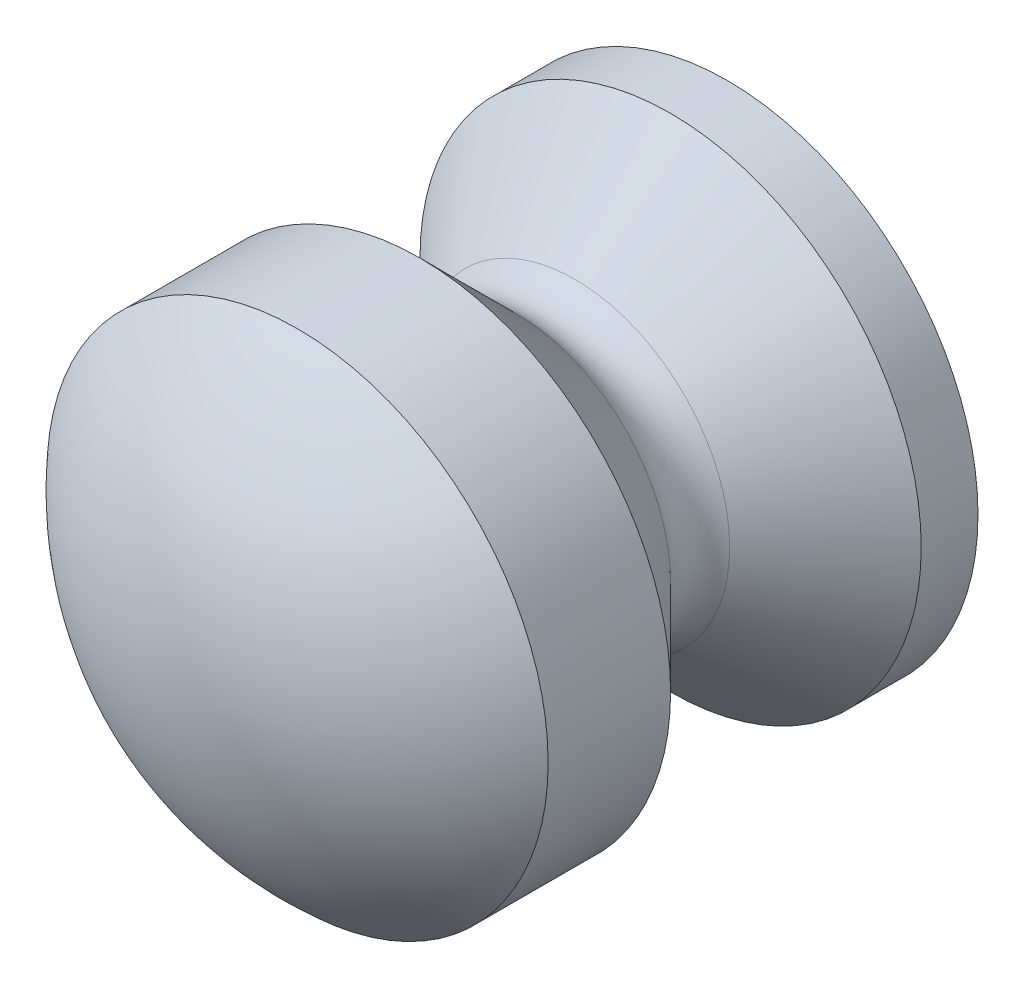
ISO-10303-21;
HEADER;
FILE_DESCRIPTION(('STEP AP214'),'2;1');
FILE_NAME('part.step','',(''),(''),'','','');
FILE_SCHEMA(('AUTOMOTIVE_DESIGN { 1 0 10303 214 1 1 1 1 }'));
ENDSEC;
DATA;
#1=APPLICATION_CONTEXT('core data for automotive mechanical design processes');
#2=APPLICATION_PROTOCOL_DEFINITION('international standard','automotive_design',2000,#1);
#3=PRODUCT_CONTEXT('',#1,'mechanical');
#4=PRODUCT('Part','Part','',(#3));
#5=PRODUCT_RELATED_PRODUCT_CATEGORY('part','',(#4));
#6=PRODUCT_DEFINITION_FORMATION('','',#4);
#7=PRODUCT_DEFINITION_CONTEXT('part definition',#1,'design');
#8=PRODUCT_DEFINITION('design','',#6,#7);
#9=PRODUCT_DEFINITION_SHAPE('','',#8);
#10=(LENGTH_UNIT() NAMED_UNIT(*) SI_UNIT(.MILLI.,.METRE.));
#11=(NAMED_UNIT(*) PLANE_ANGLE_UNIT() SI_UNIT($,.RADIAN.));
#12=(NAMED_UNIT(*) SI_UNIT($,.STERADIAN.) SOLID_ANGLE_UNIT());
#13=UNCERTAINTY_MEASURE_WITH_UNIT(LENGTH_MEASURE(1.E-05),#10,'distance_accuracy_value','');
#14=(GEOMETRIC_REPRESENTATION_CONTEXT(3) GLOBAL_UNCERTAINTY_ASSIGNED_CONTEXT((#13)) GLOBAL_UNIT_ASSIGNED_CONTEXT((#10,
#11,#12)) REPRESENTATION_CONTEXT('',''));
#15=CARTESIAN_POINT('',(0.,0.,0.));
#16=DIRECTION('',(0.,0.,1.));
#17=DIRECTION('',(1.,0.,0.));
#18=AXIS2_PLACEMENT_3D('',#15,#16,#17);
#19=CARTESIAN_POINT('',(0.,0.,-6.35));
#20=DIRECTION('',(0.,0.,1.));
#21=DIRECTION('',(0.,1.,0.));
#22=AXIS2_PLACEMENT_3D('',#19,#20,#21);
#23=SPHERICAL_SURFACE('',#22,6.35);
#24=CARTESIAN_POINT('',(0.,0.,-2.14986979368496));
#25=DIRECTION('',(0.,0.,1.));
#26=DIRECTION('',(1.,0.,0.));
#27=AXIS2_PLACEMENT_3D('',#24,#25,#26);
#28=CIRCLE('',#27,4.7625);
#29=CARTESIAN_POINT('',(4.7625,0.,-2.14986979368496));
#30=VERTEX_POINT('',#29);
#31=EDGE_CURVE('E10',#30,#30,#28,.T.);
#32=ORIENTED_EDGE('',*,*,#31,.T.);
#33=EDGE_LOOP('',(#32));
#34=FACE_BOUND('',#33,.T.);
#35=ADVANCED_FACE('F33',(#34),#23,.T.);
#36=CARTESIAN_POINT('',(0.,0.,0.));
#37=DIRECTION('',(0.,0.,1.));
#38=DIRECTION('',(1.,0.,0.));
#39=AXIS2_PLACEMENT_3D('',#36,#37,#38);
#40=CYLINDRICAL_SURFACE('',#39,4.7625);
#41=ORIENTED_EDGE('',*,*,#31,.F.);
#42=EDGE_LOOP('',(#41));
#43=FACE_BOUND('',#42,.T.);
#44=CARTESIAN_POINT('',(0.,0.,-4.47674999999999));
#45=DIRECTION('',(0.,0.,1.));
#46=DIRECTION('',(1.,0.,0.));
#47=AXIS2_PLACEMENT_3D('',#44,#45,#46);
#48=CIRCLE('',#47,4.7625);
#49=CARTESIAN_POINT('',(4.7625,0.,-4.47674999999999));
#50=VERTEX_POINT('',#49);
#51=EDGE_CURVE('E39',#50,#50,#48,.T.);
#52=ORIENTED_EDGE('',*,*,#51,.T.);
#53=EDGE_LOOP('',(#52));
#54=FACE_BOUND('',#53,.T.);
#55=ADVANCED_FACE('F71',(#43,#54),#40,.T.);
#56=CARTESIAN_POINT('',(0.,0.,-6.29673399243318));
#57=DIRECTION('',(0.,0.,1.));
#58=DIRECTION('',(1.,0.,0.));
#59=AXIS2_PLACEMENT_3D('',#56,#57,#58);
#60=CONICAL_SURFACE('',#59,2.94251600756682,0.785398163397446);
#61=ORIENTED_EDGE('',*,*,#51,.F.);
#62=EDGE_LOOP('',(#61));
#63=FACE_BOUND('',#62,.T.);
#64=CARTESIAN_POINT('',(0.,0.,-6.29673399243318));
#65=DIRECTION('',(0.,0.,1.));
#66=DIRECTION('',(1.,0.,0.));
#67=AXIS2_PLACEMENT_3D('',#64,#65,#66);
#68=CIRCLE('',#67,2.94251600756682);
#69=CARTESIAN_POINT('',(2.94251600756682,0.,-6.29673399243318));
#70=VERTEX_POINT('',#69);
#71=EDGE_CURVE('E43',#70,#70,#68,.T.);
#72=ORIENTED_EDGE('',*,*,#71,.T.);
#73=EDGE_LOOP('',(#72));
#74=FACE_BOUND('',#73,.T.);
#75=ADVANCED_FACE('F75',(#63,#74),#60,.T.);
#76=CARTESIAN_POINT('',(0.,0.,-6.858));
#77=DIRECTION('',(0.,0.,1.));
#78=DIRECTION('',(1.,0.,0.));
#79=AXIS2_PLACEMENT_3D('',#76,#77,#78);
#80=TOROIDAL_SURFACE('',#79,3.50378201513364,0.79375);
#81=ORIENTED_EDGE('',*,*,#71,.F.);
#82=EDGE_LOOP('',(#81));
#83=FACE_BOUND('',#82,.T.);
#84=CARTESIAN_POINT('',(0.,0.,-7.41926600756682));
#85=DIRECTION('',(0.,0.,1.));
#86=DIRECTION('',(1.,0.,0.));
#87=AXIS2_PLACEMENT_3D('',#84,#85,#86);
#88=CIRCLE('',#87,2.94251600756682);
#89=CARTESIAN_POINT('',(2.94251600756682,0.,-7.41926600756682));
#90=VERTEX_POINT('',#89);
#91=EDGE_CURVE('E47',#90,#90,#88,.T.);
#92=ORIENTED_EDGE('',*,*,#91,.T.);
#93=EDGE_LOOP('',(#92));
#94=FACE_BOUND('',#93,.T.);
#95=ADVANCED_FACE('F80',(#83,#94),#80,.F.);
#96=CARTESIAN_POINT('',(0.,0.,-9.23924999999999));
#97=DIRECTION('',(0.,0.,-1.));
#98=DIRECTION('',(-1.,0.,0.));
#99=AXIS2_PLACEMENT_3D('',#96,#97,#98);
#100=CONICAL_SURFACE('',#99,4.7625,0.78539816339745);
#101=ORIENTED_EDGE('',*,*,#91,.F.);
#102=EDGE_LOOP('',(#101));
#103=FACE_BOUND('',#102,.T.);
#104=CARTESIAN_POINT('',(0.,0.,-9.23924999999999));
#105=DIRECTION('',(0.,0.,1.));
#106=DIRECTION('',(1.,0.,0.));
#107=AXIS2_PLACEMENT_3D('',#104,#105,#106);
#108=CIRCLE('',#107,4.7625);
#109=CARTESIAN_POINT('',(4.7625,0.,-9.23924999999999));
#110=VERTEX_POINT('',#109);
#111=EDGE_CURVE('E52',#110,#110,#108,.T.);
#112=ORIENTED_EDGE('',*,*,#111,.T.);
#113=EDGE_LOOP('',(#112));
#114=FACE_BOUND('',#113,.T.);
#115=ADVANCED_FACE('F67',(#103,#114),#100,.T.);
#116=CARTESIAN_POINT('',(0.,0.,0.));
#117=DIRECTION('',(0.,0.,1.));
#118=DIRECTION('',(1.,0.,0.));
#119=AXIS2_PLACEMENT_3D('',#116,#117,#118);
#120=CYLINDRICAL_SURFACE('',#119,4.7625);
#121=ORIENTED_EDGE('',*,*,#111,.F.);
#122=EDGE_LOOP('',(#121));
#123=FACE_BOUND('',#122,.T.);
#124=CARTESIAN_POINT('',(0.,0.,-10.31875));
#125=DIRECTION('',(0.,0.,1.));
#126=DIRECTION('',(1.,0.,0.));
#127=AXIS2_PLACEMENT_3D('',#124,#125,#126);
#128=CIRCLE('',#127,4.7625);
#129=CARTESIAN_POINT('',(4.7625,0.,-10.31875));
#130=VERTEX_POINT('',#129);
#131=EDGE_CURVE('E55',#130,#130,#128,.T.);
#132=ORIENTED_EDGE('',*,*,#131,.T.);
#133=EDGE_LOOP('',(#132));
#134=FACE_BOUND('',#133,.T.);
#135=ADVANCED_FACE('F59',(#123,#134),#120,.T.);
#136=CARTESIAN_POINT('',(0.,4.7625,-10.31875));
#137=DIRECTION('',(0.,0.,1.));
#138=DIRECTION('',(1.,0.,0.));
#139=AXIS2_PLACEMENT_3D('',#136,#137,#138);
#140=PLANE('',#139);
#141=ORIENTED_EDGE('',*,*,#131,.F.);
#142=EDGE_LOOP('',(#141));
#143=FACE_BOUND('',#142,.T.);
#144=ADVANCED_FACE('F61',(#143),#140,.F.);
#145=CLOSED_SHELL('',(#35,#55,#75,#95,#115,#135,#144));
#146=MANIFOLD_SOLID_BREP('B2',#145);
#147=ADVANCED_BREP_SHAPE_REPRESENTATION('',(#18,#146),#14);
#148=SHAPE_DEFINITION_REPRESENTATION(#9,#147);
ENDSEC;
END-ISO-10303-21;
